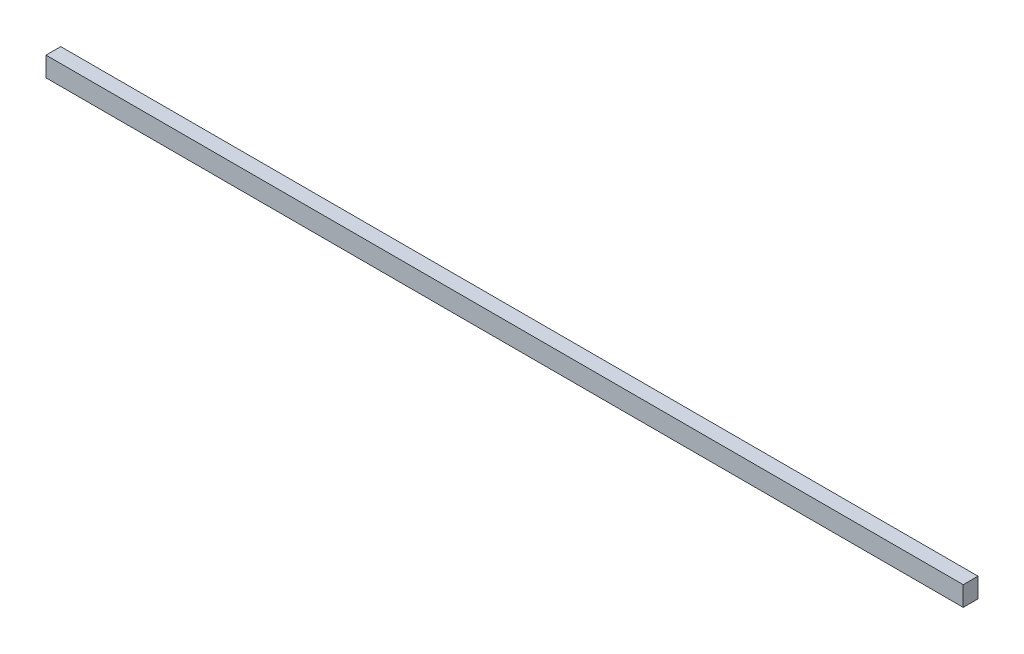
ISO-10303-21;
HEADER;
FILE_DESCRIPTION(('STEP AP214'),'2;1');
FILE_NAME('part.step','',(''),(''),'','','');
FILE_SCHEMA(('AUTOMOTIVE_DESIGN { 1 0 10303 214 1 1 1 1 }'));
ENDSEC;
DATA;
#1=APPLICATION_CONTEXT('core data for automotive mechanical design processes');
#2=APPLICATION_PROTOCOL_DEFINITION('international standard','automotive_design',2000,#1);
#3=PRODUCT_CONTEXT('',#1,'mechanical');
#4=PRODUCT('Part','Part','',(#3));
#5=PRODUCT_RELATED_PRODUCT_CATEGORY('part','',(#4));
#6=PRODUCT_DEFINITION_FORMATION('','',#4);
#7=PRODUCT_DEFINITION_CONTEXT('part definition',#1,'design');
#8=PRODUCT_DEFINITION('design','',#6,#7);
#9=PRODUCT_DEFINITION_SHAPE('','',#8);
#10=(LENGTH_UNIT() NAMED_UNIT(*) SI_UNIT(.MILLI.,.METRE.));
#11=(NAMED_UNIT(*) PLANE_ANGLE_UNIT() SI_UNIT($,.RADIAN.));
#12=(NAMED_UNIT(*) SI_UNIT($,.STERADIAN.) SOLID_ANGLE_UNIT());
#13=UNCERTAINTY_MEASURE_WITH_UNIT(LENGTH_MEASURE(1.E-05),#10,'distance_accuracy_value','');
#14=(GEOMETRIC_REPRESENTATION_CONTEXT(3) GLOBAL_UNCERTAINTY_ASSIGNED_CONTEXT((#13)) GLOBAL_UNIT_ASSIGNED_CONTEXT((#10,
#11,#12)) REPRESENTATION_CONTEXT('',''));
#15=CARTESIAN_POINT('',(0.,0.,0.));
#16=DIRECTION('',(0.,0.,1.));
#17=DIRECTION('',(1.,0.,0.));
#18=AXIS2_PLACEMENT_3D('',#15,#16,#17);
#19=CARTESIAN_POINT('',(-71.7053568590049,37.3255491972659,3.81));
#20=DIRECTION('',(1.,0.,0.));
#21=DIRECTION('',(0.,0.,-1.));
#22=AXIS2_PLACEMENT_3D('',#19,#20,#21);
#23=PLANE('',#22);
#24=DIRECTION('',(0.,-1.,0.));
#25=VECTOR('',#24,1.);
#26=CARTESIAN_POINT('',(-71.7053568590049,37.3255491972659,0.));
#27=LINE('',#26,#25);
#28=CARTESIAN_POINT('',(-71.7053568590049,37.3255491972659,0.));
#29=VERTEX_POINT('',#28);
#30=CARTESIAN_POINT('',(-71.7053568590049,32.2455491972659,0.));
#31=VERTEX_POINT('',#30);
#32=EDGE_CURVE('E75',#29,#31,#27,.T.);
#33=ORIENTED_EDGE('',*,*,#32,.T.);
#34=DIRECTION('',(0.,0.,-1.));
#35=VECTOR('',#34,1.);
#36=CARTESIAN_POINT('',(-71.7053568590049,32.2455491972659,3.81));
#37=LINE('',#36,#35);
#38=CARTESIAN_POINT('',(-71.7053568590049,32.2455491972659,3.81));
#39=VERTEX_POINT('',#38);
#40=EDGE_CURVE('E11',#39,#31,#37,.T.);
#41=ORIENTED_EDGE('',*,*,#40,.F.);
#42=DIRECTION('',(0.,-1.,0.));
#43=VECTOR('',#42,1.);
#44=CARTESIAN_POINT('',(-71.7053568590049,37.3255491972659,3.81));
#45=LINE('',#44,#43);
#46=CARTESIAN_POINT('',(-71.7053568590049,37.3255491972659,3.81));
#47=VERTEX_POINT('',#46);
#48=EDGE_CURVE('E93',#47,#39,#45,.T.);
#49=ORIENTED_EDGE('',*,*,#48,.F.);
#50=DIRECTION('',(0.,0.,-1.));
#51=VECTOR('',#50,1.);
#52=CARTESIAN_POINT('',(-71.7053568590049,37.3255491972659,3.81));
#53=LINE('',#52,#51);
#54=EDGE_CURVE('E87',#47,#29,#53,.T.);
#55=ORIENTED_EDGE('',*,*,#54,.T.);
#56=EDGE_LOOP('',(#33,#41,#49,#55));
#57=FACE_BOUND('',#56,.T.);
#58=ADVANCED_FACE('F31',(#57),#23,.F.);
#59=CARTESIAN_POINT('',(-71.7053568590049,32.2455491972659,3.81));
#60=DIRECTION('',(0.,1.,0.));
#61=DIRECTION('',(0.,0.,1.));
#62=AXIS2_PLACEMENT_3D('',#59,#60,#61);
#63=PLANE('',#62);
#64=DIRECTION('',(1.,0.,0.));
#65=VECTOR('',#64,1.);
#66=CARTESIAN_POINT('',(-71.7053568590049,32.2455491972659,0.));
#67=LINE('',#66,#65);
#68=CARTESIAN_POINT('',(165.022643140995,32.2455491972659,0.));
#69=VERTEX_POINT('',#68);
#70=EDGE_CURVE('E71',#31,#69,#67,.T.);
#71=ORIENTED_EDGE('',*,*,#70,.T.);
#72=DIRECTION('',(0.,0.,-1.));
#73=VECTOR('',#72,1.);
#74=CARTESIAN_POINT('',(165.022643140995,32.2455491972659,3.81));
#75=LINE('',#74,#73);
#76=CARTESIAN_POINT('',(165.022643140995,32.2455491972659,3.81));
#77=VERTEX_POINT('',#76);
#78=EDGE_CURVE('E38',#77,#69,#75,.T.);
#79=ORIENTED_EDGE('',*,*,#78,.F.);
#80=DIRECTION('',(1.,0.,0.));
#81=VECTOR('',#80,1.);
#82=CARTESIAN_POINT('',(-71.7053568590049,32.2455491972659,3.81));
#83=LINE('',#82,#81);
#84=EDGE_CURVE('E83',#39,#77,#83,.T.);
#85=ORIENTED_EDGE('',*,*,#84,.F.);
#86=ORIENTED_EDGE('',*,*,#40,.T.);
#87=EDGE_LOOP('',(#71,#79,#85,#86));
#88=FACE_BOUND('',#87,.T.);
#89=ADVANCED_FACE('F82',(#88),#63,.F.);
#90=CARTESIAN_POINT('',(165.022643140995,37.3255491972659,3.81));
#91=DIRECTION('',(-1.,0.,0.));
#92=DIRECTION('',(0.,0.,1.));
#93=AXIS2_PLACEMENT_3D('',#90,#91,#92);
#94=PLANE('',#93);
#95=DIRECTION('',(0.,1.,0.));
#96=VECTOR('',#95,1.);
#97=CARTESIAN_POINT('',(165.022643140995,37.3255491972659,0.));
#98=LINE('',#97,#96);
#99=CARTESIAN_POINT('',(165.022643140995,37.3255491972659,0.));
#100=VERTEX_POINT('',#99);
#101=EDGE_CURVE('E76',#69,#100,#98,.T.);
#102=ORIENTED_EDGE('',*,*,#101,.T.);
#103=DIRECTION('',(0.,0.,-1.));
#104=VECTOR('',#103,1.);
#105=CARTESIAN_POINT('',(165.022643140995,37.3255491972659,3.81));
#106=LINE('',#105,#104);
#107=CARTESIAN_POINT('',(165.022643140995,37.3255491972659,3.81));
#108=VERTEX_POINT('',#107);
#109=EDGE_CURVE('E99',#108,#100,#106,.T.);
#110=ORIENTED_EDGE('',*,*,#109,.F.);
#111=DIRECTION('',(0.,1.,0.));
#112=VECTOR('',#111,1.);
#113=CARTESIAN_POINT('',(165.022643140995,37.3255491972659,3.81));
#114=LINE('',#113,#112);
#115=EDGE_CURVE('E50',#77,#108,#114,.T.);
#116=ORIENTED_EDGE('',*,*,#115,.F.);
#117=ORIENTED_EDGE('',*,*,#78,.T.);
#118=EDGE_LOOP('',(#102,#110,#116,#117));
#119=FACE_BOUND('',#118,.T.);
#120=ADVANCED_FACE('F102',(#119),#94,.F.);
#121=CARTESIAN_POINT('',(-71.7053568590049,37.3255491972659,3.81));
#122=DIRECTION('',(0.,-1.,0.));
#123=DIRECTION('',(0.,0.,-1.));
#124=AXIS2_PLACEMENT_3D('',#121,#122,#123);
#125=PLANE('',#124);
#126=DIRECTION('',(-1.,0.,0.));
#127=VECTOR('',#126,1.);
#128=CARTESIAN_POINT('',(-71.7053568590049,37.3255491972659,0.));
#129=LINE('',#128,#127);
#130=EDGE_CURVE('E91',#100,#29,#129,.T.);
#131=ORIENTED_EDGE('',*,*,#130,.T.);
#132=ORIENTED_EDGE('',*,*,#54,.F.);
#133=DIRECTION('',(-1.,0.,0.));
#134=VECTOR('',#133,1.);
#135=CARTESIAN_POINT('',(-71.7053568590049,37.3255491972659,3.81));
#136=LINE('',#135,#134);
#137=EDGE_CURVE('E45',#108,#47,#136,.T.);
#138=ORIENTED_EDGE('',*,*,#137,.F.);
#139=ORIENTED_EDGE('',*,*,#109,.T.);
#140=EDGE_LOOP('',(#131,#132,#138,#139));
#141=FACE_BOUND('',#140,.T.);
#142=ADVANCED_FACE('F104',(#141),#125,.F.);
#143=CARTESIAN_POINT('',(-71.7053568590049,32.2455491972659,3.81));
#144=DIRECTION('',(0.,0.,1.));
#145=DIRECTION('',(1.,0.,0.));
#146=AXIS2_PLACEMENT_3D('',#143,#144,#145);
#147=PLANE('',#146);
#148=ORIENTED_EDGE('',*,*,#48,.T.);
#149=ORIENTED_EDGE('',*,*,#84,.T.);
#150=ORIENTED_EDGE('',*,*,#115,.T.);
#151=ORIENTED_EDGE('',*,*,#137,.T.);
#152=EDGE_LOOP('',(#148,#149,#150,#151));
#153=FACE_BOUND('',#152,.T.);
#154=ADVANCED_FACE('F105',(#153),#147,.T.);
#155=CARTESIAN_POINT('',(-71.7053568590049,32.2455491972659,0.));
#156=DIRECTION('',(0.,0.,1.));
#157=DIRECTION('',(1.,0.,0.));
#158=AXIS2_PLACEMENT_3D('',#155,#156,#157);
#159=PLANE('',#158);
#160=ORIENTED_EDGE('',*,*,#32,.F.);
#161=ORIENTED_EDGE('',*,*,#130,.F.);
#162=ORIENTED_EDGE('',*,*,#101,.F.);
#163=ORIENTED_EDGE('',*,*,#70,.F.);
#164=EDGE_LOOP('',(#160,#161,#162,#163));
#165=FACE_BOUND('',#164,.T.);
#166=ADVANCED_FACE('F72',(#165),#159,.F.);
#167=CLOSED_SHELL('',(#58,#89,#120,#142,#154,#166));
#168=MANIFOLD_SOLID_BREP('B2',#167);
#169=ADVANCED_BREP_SHAPE_REPRESENTATION('',(#18,#168),#14);
#170=SHAPE_DEFINITION_REPRESENTATION(#9,#169);
ENDSEC;
END-ISO-10303-21;
